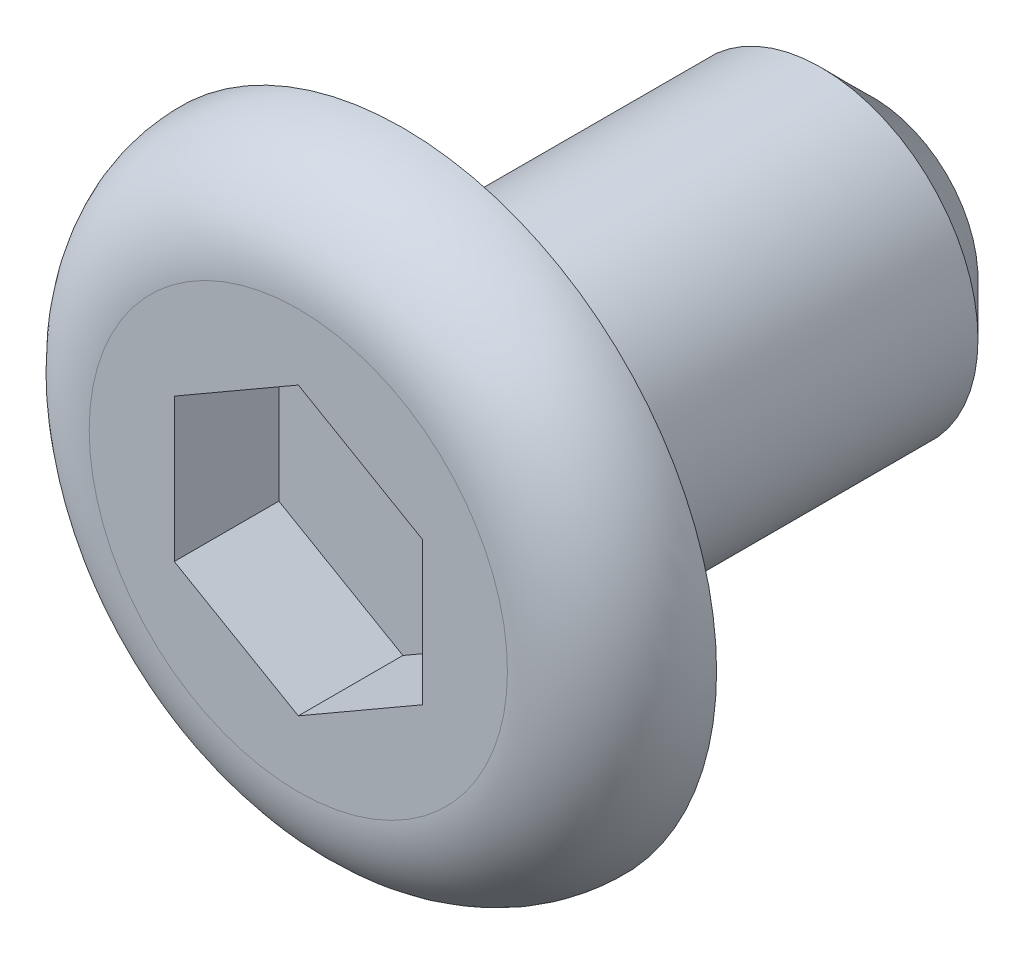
ISO-10303-21;
HEADER;
FILE_DESCRIPTION(('STEP AP214'),'2;1');
FILE_NAME('part.step','',(''),(''),'','','');
FILE_SCHEMA(('AUTOMOTIVE_DESIGN { 1 0 10303 214 1 1 1 1 }'));
ENDSEC;
DATA;
#1=APPLICATION_CONTEXT('core data for automotive mechanical design processes');
#2=APPLICATION_PROTOCOL_DEFINITION('international standard','automotive_design',2000,#1);
#3=PRODUCT_CONTEXT('',#1,'mechanical');
#4=PRODUCT('Part','Part','',(#3));
#5=PRODUCT_RELATED_PRODUCT_CATEGORY('part','',(#4));
#6=PRODUCT_DEFINITION_FORMATION('','',#4);
#7=PRODUCT_DEFINITION_CONTEXT('part definition',#1,'design');
#8=PRODUCT_DEFINITION('design','',#6,#7);
#9=PRODUCT_DEFINITION_SHAPE('','',#8);
#10=(LENGTH_UNIT() NAMED_UNIT(*) SI_UNIT(.MILLI.,.METRE.));
#11=(NAMED_UNIT(*) PLANE_ANGLE_UNIT() SI_UNIT($,.RADIAN.));
#12=(NAMED_UNIT(*) SI_UNIT($,.STERADIAN.) SOLID_ANGLE_UNIT());
#13=UNCERTAINTY_MEASURE_WITH_UNIT(LENGTH_MEASURE(1.E-05),#10,'distance_accuracy_value','');
#14=(GEOMETRIC_REPRESENTATION_CONTEXT(3) GLOBAL_UNCERTAINTY_ASSIGNED_CONTEXT((#13)) GLOBAL_UNIT_ASSIGNED_CONTEXT((#10,
#11,#12)) REPRESENTATION_CONTEXT('',''));
#15=CARTESIAN_POINT('',(0.,0.,0.));
#16=DIRECTION('',(0.,0.,1.));
#17=DIRECTION('',(1.,0.,0.));
#18=AXIS2_PLACEMENT_3D('',#15,#16,#17);
#19=CARTESIAN_POINT('',(-10.8900369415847,115.08761918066,0.));
#20=DIRECTION('',(0.,0.,1.));
#21=DIRECTION('',(1.,0.,0.));
#22=AXIS2_PLACEMENT_3D('',#19,#20,#21);
#23=PLANE('',#22);
#24=CARTESIAN_POINT('',(-10.8900369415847,115.08761918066,0.));
#25=DIRECTION('',(0.,0.,1.));
#26=DIRECTION('',(1.,0.,0.));
#27=AXIS2_PLACEMENT_3D('',#24,#25,#26);
#28=CIRCLE('',#27,3.);
#29=CARTESIAN_POINT('',(-7.89003694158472,115.08761918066,0.));
#30=VERTEX_POINT('',#29);
#31=EDGE_CURVE('E141',#30,#30,#28,.T.);
#32=ORIENTED_EDGE('',*,*,#31,.F.);
#33=EDGE_LOOP('',(#32));
#34=FACE_BOUND('',#33,.T.);
#35=CARTESIAN_POINT('',(-10.8900369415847,115.08761918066,0.));
#36=DIRECTION('',(0.,0.,1.));
#37=DIRECTION('',(1.,0.,0.));
#38=AXIS2_PLACEMENT_3D('',#35,#36,#37);
#39=CIRCLE('',#38,1.5);
#40=CARTESIAN_POINT('',(-9.39003694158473,115.08761918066,0.));
#41=VERTEX_POINT('',#40);
#42=EDGE_CURVE('E149',#41,#41,#39,.F.);
#43=ORIENTED_EDGE('',*,*,#42,.F.);
#44=EDGE_LOOP('',(#43));
#45=FACE_BOUND('',#44,.T.);
#46=ADVANCED_FACE('F39',(#34,#45),#23,.F.);
#47=CARTESIAN_POINT('',(-10.8900369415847,115.08761918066,1.));
#48=DIRECTION('',(0.,0.,1.));
#49=DIRECTION('',(1.,0.,0.));
#50=AXIS2_PLACEMENT_3D('',#47,#48,#49);
#51=PLANE('',#50);
#52=CARTESIAN_POINT('',(-10.8900369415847,115.08761918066,1.));
#53=DIRECTION('',(0.,0.,1.));
#54=DIRECTION('',(1.,0.,0.));
#55=AXIS2_PLACEMENT_3D('',#52,#53,#54);
#56=CIRCLE('',#55,2.);
#57=CARTESIAN_POINT('',(-8.89003694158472,115.08761918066,1.));
#58=VERTEX_POINT('',#57);
#59=EDGE_CURVE('E11',#58,#58,#56,.T.);
#60=ORIENTED_EDGE('',*,*,#59,.T.);
#61=EDGE_LOOP('',(#60));
#62=FACE_BOUND('',#61,.T.);
#63=DIRECTION('',(0.866025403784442,-0.499999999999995,0.));
#64=VECTOR('',#63,1.);
#65=CARTESIAN_POINT('',(-12.0764252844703,114.402657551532,1.));
#66=LINE('',#65,#64);
#67=CARTESIAN_POINT('',(-12.0764252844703,114.402657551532,1.));
#68=VERTEX_POINT('',#67);
#69=CARTESIAN_POINT('',(-10.8900369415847,113.717695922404,1.));
#70=VERTEX_POINT('',#69);
#71=EDGE_CURVE('E54',#68,#70,#66,.T.);
#72=ORIENTED_EDGE('',*,*,#71,.F.);
#73=DIRECTION('',(0.,-1.,0.));
#74=VECTOR('',#73,1.);
#75=CARTESIAN_POINT('',(-12.0764252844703,115.772580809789,1.));
#76=LINE('',#75,#74);
#77=CARTESIAN_POINT('',(-12.0764252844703,115.772580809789,1.));
#78=VERTEX_POINT('',#77);
#79=EDGE_CURVE('E137',#78,#68,#76,.T.);
#80=ORIENTED_EDGE('',*,*,#79,.F.);
#81=DIRECTION('',(-0.866025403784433,-0.500000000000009,0.));
#82=VECTOR('',#81,1.);
#83=CARTESIAN_POINT('',(-10.8900369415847,116.457542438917,1.));
#84=LINE('',#83,#82);
#85=CARTESIAN_POINT('',(-10.8900369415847,116.457542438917,1.));
#86=VERTEX_POINT('',#85);
#87=EDGE_CURVE('E135',#86,#78,#84,.T.);
#88=ORIENTED_EDGE('',*,*,#87,.F.);
#89=DIRECTION('',(-0.86602540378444,0.499999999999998,0.));
#90=VECTOR('',#89,1.);
#91=CARTESIAN_POINT('',(-9.70364859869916,115.772580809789,1.));
#92=LINE('',#91,#90);
#93=CARTESIAN_POINT('',(-9.70364859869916,115.772580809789,1.));
#94=VERTEX_POINT('',#93);
#95=EDGE_CURVE('E102',#94,#86,#92,.T.);
#96=ORIENTED_EDGE('',*,*,#95,.F.);
#97=DIRECTION('',(0.,1.,0.));
#98=VECTOR('',#97,1.);
#99=CARTESIAN_POINT('',(-9.70364859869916,114.402657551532,1.));
#100=LINE('',#99,#98);
#101=CARTESIAN_POINT('',(-9.70364859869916,114.402657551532,1.));
#102=VERTEX_POINT('',#101);
#103=EDGE_CURVE('E131',#102,#94,#100,.T.);
#104=ORIENTED_EDGE('',*,*,#103,.F.);
#105=DIRECTION('',(0.866025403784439,0.499999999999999,0.));
#106=VECTOR('',#105,1.);
#107=CARTESIAN_POINT('',(-10.8900369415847,113.717695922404,1.));
#108=LINE('',#107,#106);
#109=EDGE_CURVE('E128',#70,#102,#108,.T.);
#110=ORIENTED_EDGE('',*,*,#109,.F.);
#111=EDGE_LOOP('',(#72,#80,#88,#96,#104,#110));
#112=FACE_BOUND('',#111,.T.);
#113=ADVANCED_FACE('F172',(#62,#112),#51,.T.);
#114=CARTESIAN_POINT('',(-10.8900369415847,115.08761918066,-4.5));
#115=DIRECTION('',(0.,0.,1.));
#116=DIRECTION('',(1.,0.,0.));
#117=AXIS2_PLACEMENT_3D('',#114,#115,#116);
#118=CYLINDRICAL_SURFACE('',#117,1.5);
#119=CARTESIAN_POINT('',(-10.8900369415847,115.08761918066,-4.));
#120=DIRECTION('',(0.,0.,-1.));
#121=DIRECTION('',(-1.,0.,0.));
#122=AXIS2_PLACEMENT_3D('',#119,#120,#121);
#123=CIRCLE('',#122,1.5);
#124=CARTESIAN_POINT('',(-12.3900369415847,115.08761918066,-4.));
#125=VERTEX_POINT('',#124);
#126=EDGE_CURVE('E47',#125,#125,#123,.F.);
#127=ORIENTED_EDGE('',*,*,#126,.T.);
#128=EDGE_LOOP('',(#127));
#129=FACE_BOUND('',#128,.T.);
#130=ORIENTED_EDGE('',*,*,#42,.T.);
#131=EDGE_LOOP('',(#130));
#132=FACE_BOUND('',#131,.T.);
#133=ADVANCED_FACE('F157',(#129,#132),#118,.T.);
#134=CARTESIAN_POINT('',(-10.8900369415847,115.08761918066,-4.5));
#135=DIRECTION('',(0.,0.,-1.));
#136=DIRECTION('',(-1.,0.,0.));
#137=AXIS2_PLACEMENT_3D('',#134,#135,#136);
#138=PLANE('',#137);
#139=CARTESIAN_POINT('',(-10.8900369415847,115.08761918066,-4.5));
#140=DIRECTION('',(0.,0.,-1.));
#141=DIRECTION('',(-1.,0.,0.));
#142=AXIS2_PLACEMENT_3D('',#139,#140,#141);
#143=CIRCLE('',#142,0.999999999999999);
#144=CARTESIAN_POINT('',(-11.8900369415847,115.08761918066,-4.5));
#145=VERTEX_POINT('',#144);
#146=EDGE_CURVE('E152',#145,#145,#143,.T.);
#147=ORIENTED_EDGE('',*,*,#146,.T.);
#148=EDGE_LOOP('',(#147));
#149=FACE_BOUND('',#148,.T.);
#150=ADVANCED_FACE('F164',(#149),#138,.T.);
#151=CARTESIAN_POINT('',(-10.8900369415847,115.08761918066,-4.5));
#152=DIRECTION('',(0.,0.,1.));
#153=DIRECTION('',(1.,0.,0.));
#154=AXIS2_PLACEMENT_3D('',#151,#152,#153);
#155=CONICAL_SURFACE('',#154,0.999999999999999,0.785398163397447);
#156=ORIENTED_EDGE('',*,*,#126,.F.);
#157=EDGE_LOOP('',(#156));
#158=FACE_BOUND('',#157,.T.);
#159=ORIENTED_EDGE('',*,*,#146,.F.);
#160=EDGE_LOOP('',(#159));
#161=FACE_BOUND('',#160,.T.);
#162=ADVANCED_FACE('F160',(#158,#161),#155,.T.);
#163=CARTESIAN_POINT('',(-12.0764252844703,114.402657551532,0.));
#164=DIRECTION('',(-0.499999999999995,-0.866025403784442,0.));
#165=DIRECTION('',(0.866025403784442,-0.499999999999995,0.));
#166=AXIS2_PLACEMENT_3D('',#163,#164,#165);
#167=PLANE('',#166);
#168=ORIENTED_EDGE('',*,*,#71,.T.);
#169=DIRECTION('',(0.,0.,1.));
#170=VECTOR('',#169,1.);
#171=CARTESIAN_POINT('',(-10.8900369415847,113.717695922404,0.));
#172=LINE('',#171,#170);
#173=CARTESIAN_POINT('',(-10.8900369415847,113.717695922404,0.));
#174=VERTEX_POINT('',#173);
#175=EDGE_CURVE('E84',#174,#70,#172,.T.);
#176=ORIENTED_EDGE('',*,*,#175,.F.);
#177=DIRECTION('',(0.866025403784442,-0.499999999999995,0.));
#178=VECTOR('',#177,1.);
#179=CARTESIAN_POINT('',(-12.0764252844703,114.402657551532,0.));
#180=LINE('',#179,#178);
#181=CARTESIAN_POINT('',(-12.0764252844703,114.402657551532,0.));
#182=VERTEX_POINT('',#181);
#183=EDGE_CURVE('E139',#182,#174,#180,.T.);
#184=ORIENTED_EDGE('',*,*,#183,.F.);
#185=DIRECTION('',(0.,0.,1.));
#186=VECTOR('',#185,1.);
#187=CARTESIAN_POINT('',(-12.0764252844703,114.402657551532,0.));
#188=LINE('',#187,#186);
#189=EDGE_CURVE('E62',#182,#68,#188,.T.);
#190=ORIENTED_EDGE('',*,*,#189,.T.);
#191=EDGE_LOOP('',(#168,#176,#184,#190));
#192=FACE_BOUND('',#191,.T.);
#193=ADVANCED_FACE('F163',(#192),#167,.F.);
#194=CARTESIAN_POINT('',(-12.0764252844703,115.772580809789,0.));
#195=DIRECTION('',(-1.,0.,0.));
#196=DIRECTION('',(0.,-1.,0.));
#197=AXIS2_PLACEMENT_3D('',#194,#195,#196);
#198=PLANE('',#197);
#199=ORIENTED_EDGE('',*,*,#79,.T.);
#200=ORIENTED_EDGE('',*,*,#189,.F.);
#201=DIRECTION('',(0.,-1.,0.));
#202=VECTOR('',#201,1.);
#203=CARTESIAN_POINT('',(-12.0764252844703,115.772580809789,0.));
#204=LINE('',#203,#202);
#205=CARTESIAN_POINT('',(-12.0764252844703,115.772580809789,0.));
#206=VERTEX_POINT('',#205);
#207=EDGE_CURVE('E114',#206,#182,#204,.T.);
#208=ORIENTED_EDGE('',*,*,#207,.F.);
#209=DIRECTION('',(0.,0.,1.));
#210=VECTOR('',#209,1.);
#211=CARTESIAN_POINT('',(-12.0764252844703,115.772580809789,0.));
#212=LINE('',#211,#210);
#213=EDGE_CURVE('E106',#206,#78,#212,.T.);
#214=ORIENTED_EDGE('',*,*,#213,.T.);
#215=EDGE_LOOP('',(#199,#200,#208,#214));
#216=FACE_BOUND('',#215,.T.);
#217=ADVANCED_FACE('F198',(#216),#198,.F.);
#218=CARTESIAN_POINT('',(-10.8900369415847,116.457542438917,0.));
#219=DIRECTION('',(-0.500000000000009,0.866025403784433,0.));
#220=DIRECTION('',(-0.866025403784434,-0.500000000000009,0.));
#221=AXIS2_PLACEMENT_3D('',#218,#219,#220);
#222=PLANE('',#221);
#223=ORIENTED_EDGE('',*,*,#87,.T.);
#224=ORIENTED_EDGE('',*,*,#213,.F.);
#225=DIRECTION('',(-0.866025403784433,-0.500000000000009,0.));
#226=VECTOR('',#225,1.);
#227=CARTESIAN_POINT('',(-10.8900369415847,116.457542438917,0.));
#228=LINE('',#227,#226);
#229=CARTESIAN_POINT('',(-10.8900369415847,116.457542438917,0.));
#230=VERTEX_POINT('',#229);
#231=EDGE_CURVE('E110',#230,#206,#228,.T.);
#232=ORIENTED_EDGE('',*,*,#231,.F.);
#233=DIRECTION('',(0.,0.,1.));
#234=VECTOR('',#233,1.);
#235=CARTESIAN_POINT('',(-10.8900369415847,116.457542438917,0.));
#236=LINE('',#235,#234);
#237=EDGE_CURVE('E95',#230,#86,#236,.T.);
#238=ORIENTED_EDGE('',*,*,#237,.T.);
#239=EDGE_LOOP('',(#223,#224,#232,#238));
#240=FACE_BOUND('',#239,.T.);
#241=ADVANCED_FACE('F111',(#240),#222,.F.);
#242=CARTESIAN_POINT('',(-9.70364859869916,115.772580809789,0.));
#243=DIRECTION('',(0.499999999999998,0.86602540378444,0.));
#244=DIRECTION('',(-0.86602540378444,0.499999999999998,0.));
#245=AXIS2_PLACEMENT_3D('',#242,#243,#244);
#246=PLANE('',#245);
#247=ORIENTED_EDGE('',*,*,#95,.T.);
#248=ORIENTED_EDGE('',*,*,#237,.F.);
#249=DIRECTION('',(-0.86602540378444,0.499999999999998,0.));
#250=VECTOR('',#249,1.);
#251=CARTESIAN_POINT('',(-9.70364859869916,115.772580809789,0.));
#252=LINE('',#251,#250);
#253=CARTESIAN_POINT('',(-9.70364859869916,115.772580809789,0.));
#254=VERTEX_POINT('',#253);
#255=EDGE_CURVE('E99',#254,#230,#252,.T.);
#256=ORIENTED_EDGE('',*,*,#255,.F.);
#257=DIRECTION('',(0.,0.,1.));
#258=VECTOR('',#257,1.);
#259=CARTESIAN_POINT('',(-9.70364859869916,115.772580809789,0.));
#260=LINE('',#259,#258);
#261=EDGE_CURVE('E107',#254,#94,#260,.T.);
#262=ORIENTED_EDGE('',*,*,#261,.T.);
#263=EDGE_LOOP('',(#247,#248,#256,#262));
#264=FACE_BOUND('',#263,.T.);
#265=ADVANCED_FACE('F97',(#264),#246,.F.);
#266=CARTESIAN_POINT('',(-9.70364859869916,114.402657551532,0.));
#267=DIRECTION('',(1.,0.,0.));
#268=DIRECTION('',(0.,1.,0.));
#269=AXIS2_PLACEMENT_3D('',#266,#267,#268);
#270=PLANE('',#269);
#271=ORIENTED_EDGE('',*,*,#103,.T.);
#272=ORIENTED_EDGE('',*,*,#261,.F.);
#273=DIRECTION('',(0.,1.,0.));
#274=VECTOR('',#273,1.);
#275=CARTESIAN_POINT('',(-9.70364859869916,114.402657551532,0.));
#276=LINE('',#275,#274);
#277=CARTESIAN_POINT('',(-9.70364859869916,114.402657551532,0.));
#278=VERTEX_POINT('',#277);
#279=EDGE_CURVE('E120',#278,#254,#276,.T.);
#280=ORIENTED_EDGE('',*,*,#279,.F.);
#281=DIRECTION('',(0.,0.,1.));
#282=VECTOR('',#281,1.);
#283=CARTESIAN_POINT('',(-9.70364859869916,114.402657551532,0.));
#284=LINE('',#283,#282);
#285=EDGE_CURVE('E144',#278,#102,#284,.T.);
#286=ORIENTED_EDGE('',*,*,#285,.T.);
#287=EDGE_LOOP('',(#271,#272,#280,#286));
#288=FACE_BOUND('',#287,.T.);
#289=ADVANCED_FACE('F206',(#288),#270,.F.);
#290=CARTESIAN_POINT('',(-10.8900369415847,113.717695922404,0.));
#291=DIRECTION('',(0.499999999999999,-0.866025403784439,0.));
#292=DIRECTION('',(0.866025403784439,0.499999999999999,0.));
#293=AXIS2_PLACEMENT_3D('',#290,#291,#292);
#294=PLANE('',#293);
#295=ORIENTED_EDGE('',*,*,#109,.T.);
#296=ORIENTED_EDGE('',*,*,#285,.F.);
#297=DIRECTION('',(0.866025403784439,0.499999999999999,0.));
#298=VECTOR('',#297,1.);
#299=CARTESIAN_POINT('',(-10.8900369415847,113.717695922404,0.));
#300=LINE('',#299,#298);
#301=EDGE_CURVE('E122',#174,#278,#300,.T.);
#302=ORIENTED_EDGE('',*,*,#301,.F.);
#303=ORIENTED_EDGE('',*,*,#175,.T.);
#304=EDGE_LOOP('',(#295,#296,#302,#303));
#305=FACE_BOUND('',#304,.T.);
#306=ADVANCED_FACE('F195',(#305),#294,.F.);
#307=CARTESIAN_POINT('',(0.,0.,0.));
#308=DIRECTION('',(0.,0.,1.));
#309=DIRECTION('',(1.,0.,0.));
#310=AXIS2_PLACEMENT_3D('',#307,#308,#309);
#311=PLANE('',#310);
#312=ORIENTED_EDGE('',*,*,#183,.T.);
#313=ORIENTED_EDGE('',*,*,#301,.T.);
#314=ORIENTED_EDGE('',*,*,#279,.T.);
#315=ORIENTED_EDGE('',*,*,#255,.T.);
#316=ORIENTED_EDGE('',*,*,#231,.T.);
#317=ORIENTED_EDGE('',*,*,#207,.T.);
#318=EDGE_LOOP('',(#312,#313,#314,#315,#316,#317));
#319=FACE_BOUND('',#318,.T.);
#320=ADVANCED_FACE('F117',(#319),#311,.T.);
#321=CARTESIAN_POINT('',(-10.8900369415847,115.08761918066,0.));
#322=DIRECTION('',(0.,0.,1.));
#323=DIRECTION('',(1.,0.,0.));
#324=AXIS2_PLACEMENT_3D('',#321,#322,#323);
#325=TOROIDAL_SURFACE('',#324,2.,1.);
#326=ORIENTED_EDGE('',*,*,#31,.T.);
#327=EDGE_LOOP('',(#326));
#328=FACE_BOUND('',#327,.T.);
#329=ORIENTED_EDGE('',*,*,#59,.F.);
#330=EDGE_LOOP('',(#329));
#331=FACE_BOUND('',#330,.T.);
#332=ADVANCED_FACE('F41',(#328,#331),#325,.T.);
#333=CLOSED_SHELL('',(#46,#113,#133,#150,#162,#193,#217,#241,#265,#289,#306,#320,#332));
#334=MANIFOLD_SOLID_BREP('B2',#333);
#335=ADVANCED_BREP_SHAPE_REPRESENTATION('',(#18,#334),#14);
#336=SHAPE_DEFINITION_REPRESENTATION(#9,#335);
ENDSEC;
END-ISO-10303-21;
